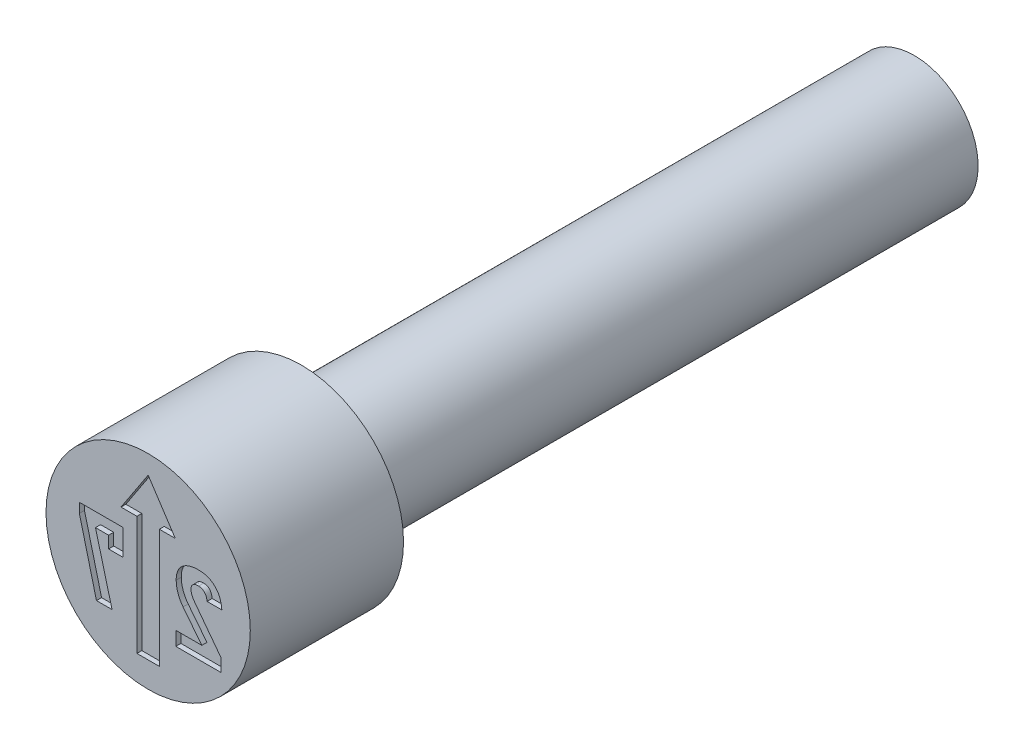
ISO-10303-21;
HEADER;
FILE_DESCRIPTION(('STEP AP214'),'2;1');
FILE_NAME('part.step','',(''),(''),'','','');
FILE_SCHEMA(('AUTOMOTIVE_DESIGN { 1 0 10303 214 1 1 1 1 }'));
ENDSEC;
DATA;
#1=APPLICATION_CONTEXT('core data for automotive mechanical design processes');
#2=APPLICATION_PROTOCOL_DEFINITION('international standard','automotive_design',2000,#1);
#3=PRODUCT_CONTEXT('',#1,'mechanical');
#4=PRODUCT('Part','Part','',(#3));
#5=PRODUCT_RELATED_PRODUCT_CATEGORY('part','',(#4));
#6=PRODUCT_DEFINITION_FORMATION('','',#4);
#7=PRODUCT_DEFINITION_CONTEXT('part definition',#1,'design');
#8=PRODUCT_DEFINITION('design','',#6,#7);
#9=PRODUCT_DEFINITION_SHAPE('','',#8);
#10=(LENGTH_UNIT() NAMED_UNIT(*) SI_UNIT(.MILLI.,.METRE.));
#11=(NAMED_UNIT(*) PLANE_ANGLE_UNIT() SI_UNIT($,.RADIAN.));
#12=(NAMED_UNIT(*) SI_UNIT($,.STERADIAN.) SOLID_ANGLE_UNIT());
#13=UNCERTAINTY_MEASURE_WITH_UNIT(LENGTH_MEASURE(1.E-05),#10,'distance_accuracy_value','');
#14=(GEOMETRIC_REPRESENTATION_CONTEXT(3) GLOBAL_UNCERTAINTY_ASSIGNED_CONTEXT((#13)) GLOBAL_UNIT_ASSIGNED_CONTEXT((#10,
#11,#12)) REPRESENTATION_CONTEXT('',''));
#15=CARTESIAN_POINT('',(0.,0.,0.));
#16=DIRECTION('',(0.,0.,1.));
#17=DIRECTION('',(1.,0.,0.));
#18=AXIS2_PLACEMENT_3D('',#15,#16,#17);
#19=CARTESIAN_POINT('',(-0.22,-1.5,-2.72238250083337));
#20=DIRECTION('',(-1.,0.,0.));
#21=DIRECTION('',(0.,0.,1.));
#22=AXIS2_PLACEMENT_3D('',#19,#20,#21);
#23=PLANE('',#22);
#24=DIRECTION('',(0.,-1.,0.));
#25=VECTOR('',#24,1.);
#26=CARTESIAN_POINT('',(-0.22,0.825524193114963,-0.0955992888));
#27=LINE('',#26,#25);
#28=CARTESIAN_POINT('',(-0.22,0.825524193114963,-0.0955992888));
#29=VERTEX_POINT('',#28);
#30=CARTESIAN_POINT('',(-0.22,-1.5,-0.0955992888));
#31=VERTEX_POINT('',#30);
#32=EDGE_CURVE('E439',#29,#31,#27,.T.);
#33=ORIENTED_EDGE('',*,*,#32,.F.);
#34=DIRECTION('',(0.,0.,1.));
#35=VECTOR('',#34,1.);
#36=CARTESIAN_POINT('',(-0.22,0.825524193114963,-0.1777996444));
#37=LINE('',#36,#35);
#38=CARTESIAN_POINT('',(-0.22,0.825524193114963,0.));
#39=VERTEX_POINT('',#38);
#40=EDGE_CURVE('E425',#39,#29,#37,.F.);
#41=ORIENTED_EDGE('',*,*,#40,.F.);
#42=DIRECTION('',(0.,1.,0.));
#43=VECTOR('',#42,1.);
#44=CARTESIAN_POINT('',(-0.22,0.,0.));
#45=LINE('',#44,#43);
#46=CARTESIAN_POINT('',(-0.22,-1.5,0.));
#47=VERTEX_POINT('',#46);
#48=EDGE_CURVE('E468',#47,#39,#45,.T.);
#49=ORIENTED_EDGE('',*,*,#48,.F.);
#50=DIRECTION('',(0.,0.,-1.));
#51=VECTOR('',#50,1.);
#52=CARTESIAN_POINT('',(-0.22,-1.5,-2.72238250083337));
#53=LINE('',#52,#51);
#54=EDGE_CURVE('E470',#47,#31,#53,.T.);
#55=ORIENTED_EDGE('',*,*,#54,.T.);
#56=EDGE_LOOP('',(#33,#41,#49,#55));
#57=FACE_BOUND('',#56,.T.);
#58=ADVANCED_FACE('F37',(#57),#23,.F.);
#59=CARTESIAN_POINT('',(3.41059817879E-13,0.825524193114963,-0.1777996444));
#60=DIRECTION('',(0.,1.,0.));
#61=DIRECTION('',(0.,0.,1.));
#62=AXIS2_PLACEMENT_3D('',#59,#60,#61);
#63=PLANE('',#62);
#64=ORIENTED_EDGE('',*,*,#40,.T.);
#65=DIRECTION('',(1.,0.,0.));
#66=VECTOR('',#65,1.);
#67=CARTESIAN_POINT('',(-0.532051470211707,0.825524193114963,-0.0955992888));
#68=LINE('',#67,#66);
#69=CARTESIAN_POINT('',(-0.532051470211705,0.825524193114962,-0.0955992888));
#70=VERTEX_POINT('',#69);
#71=EDGE_CURVE('E427',#70,#29,#68,.T.);
#72=ORIENTED_EDGE('',*,*,#71,.F.);
#73=DIRECTION('',(0.,0.,1.));
#74=VECTOR('',#73,1.);
#75=CARTESIAN_POINT('',(-0.532051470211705,0.825524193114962,-0.8127983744));
#76=LINE('',#75,#74);
#77=CARTESIAN_POINT('',(-0.532051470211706,0.825524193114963,0.));
#78=VERTEX_POINT('',#77);
#79=EDGE_CURVE('E432',#70,#78,#76,.T.);
#80=ORIENTED_EDGE('',*,*,#79,.T.);
#81=DIRECTION('',(1.,0.,0.));
#82=VECTOR('',#81,1.);
#83=CARTESIAN_POINT('',(0.999998,0.825524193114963,0.));
#84=LINE('',#83,#82);
#85=EDGE_CURVE('E430',#39,#78,#84,.F.);
#86=ORIENTED_EDGE('',*,*,#85,.F.);
#87=EDGE_LOOP('',(#64,#72,#80,#86));
#88=FACE_BOUND('',#87,.T.);
#89=ADVANCED_FACE('F415',(#88),#63,.T.);
#90=CARTESIAN_POINT('',(-0.902397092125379,0.263394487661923,-0.8127983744));
#91=DIRECTION('',(-0.835059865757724,0.550159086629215,0.));
#92=DIRECTION('',(-0.550159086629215,-0.835059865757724,0.));
#93=AXIS2_PLACEMENT_3D('',#90,#91,#92);
#94=PLANE('',#93);
#95=DIRECTION('',(-0.550159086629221,-0.83505986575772,0.));
#96=VECTOR('',#95,1.);
#97=CARTESIAN_POINT('',(0.,1.63309938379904,-0.0955992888));
#98=LINE('',#97,#96);
#99=CARTESIAN_POINT('',(0.,1.63309938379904,-0.0955992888));
#100=VERTEX_POINT('',#99);
#101=EDGE_CURVE('E441',#100,#70,#98,.T.);
#102=ORIENTED_EDGE('',*,*,#101,.F.);
#103=DIRECTION('',(0.,0.,1.));
#104=VECTOR('',#103,1.);
#105=CARTESIAN_POINT('',(0.,1.63309938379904,-0.8127983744));
#106=LINE('',#105,#104);
#107=CARTESIAN_POINT('',(0.,1.63309938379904,0.));
#108=VERTEX_POINT('',#107);
#109=EDGE_CURVE('E480',#100,#108,#106,.T.);
#110=ORIENTED_EDGE('',*,*,#109,.T.);
#111=DIRECTION('',(0.550159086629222,0.835059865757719,0.));
#112=VECTOR('',#111,1.);
#113=CARTESIAN_POINT('',(-0.532051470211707,0.825524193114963,0.));
#114=LINE('',#113,#112);
#115=EDGE_CURVE('E464',#78,#108,#114,.T.);
#116=ORIENTED_EDGE('',*,*,#115,.F.);
#117=ORIENTED_EDGE('',*,*,#79,.F.);
#118=EDGE_LOOP('',(#102,#110,#116,#117));
#119=FACE_BOUND('',#118,.T.);
#120=ADVANCED_FACE('F412',(#119),#94,.F.);
#121=CARTESIAN_POINT('',(0.,1.63309938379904,-0.8127983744));
#122=DIRECTION('',(0.835059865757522,0.550159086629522,0.));
#123=DIRECTION('',(-0.550159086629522,0.835059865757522,0.));
#124=AXIS2_PLACEMENT_3D('',#121,#122,#123);
#125=PLANE('',#124);
#126=DIRECTION('',(-0.550159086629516,0.835059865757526,0.));
#127=VECTOR('',#126,1.);
#128=CARTESIAN_POINT('',(0.532051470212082,0.825524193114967,-0.0955992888));
#129=LINE('',#128,#127);
#130=CARTESIAN_POINT('',(0.532051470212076,0.825524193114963,-0.0955992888));
#131=VERTEX_POINT('',#130);
#132=EDGE_CURVE('E445',#131,#100,#129,.T.);
#133=ORIENTED_EDGE('',*,*,#132,.F.);
#134=DIRECTION('',(0.,0.,1.));
#135=VECTOR('',#134,1.);
#136=CARTESIAN_POINT('',(0.532051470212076,0.825524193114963,-0.1777996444));
#137=LINE('',#136,#135);
#138=CARTESIAN_POINT('',(0.532051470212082,0.825524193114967,0.));
#139=VERTEX_POINT('',#138);
#140=EDGE_CURVE('E477',#139,#131,#137,.F.);
#141=ORIENTED_EDGE('',*,*,#140,.F.);
#142=DIRECTION('',(0.550159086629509,-0.83505986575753,0.));
#143=VECTOR('',#142,1.);
#144=CARTESIAN_POINT('',(0.,1.63309938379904,0.));
#145=LINE('',#144,#143);
#146=EDGE_CURVE('E461',#108,#139,#145,.T.);
#147=ORIENTED_EDGE('',*,*,#146,.F.);
#148=ORIENTED_EDGE('',*,*,#109,.F.);
#149=EDGE_LOOP('',(#133,#141,#147,#148));
#150=FACE_BOUND('',#149,.T.);
#151=ADVANCED_FACE('F408',(#150),#125,.F.);
#152=CARTESIAN_POINT('',(3.41059817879E-13,0.825524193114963,-0.1777996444));
#153=DIRECTION('',(0.,1.,0.));
#154=DIRECTION('',(0.,0.,1.));
#155=AXIS2_PLACEMENT_3D('',#152,#153,#154);
#156=PLANE('',#155);
#157=ORIENTED_EDGE('',*,*,#140,.T.);
#158=DIRECTION('',(1.,0.,0.));
#159=VECTOR('',#158,1.);
#160=CARTESIAN_POINT('',(0.22,0.825524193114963,-0.0955992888));
#161=LINE('',#160,#159);
#162=CARTESIAN_POINT('',(0.22,0.825524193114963,-0.0955992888));
#163=VERTEX_POINT('',#162);
#164=EDGE_CURVE('E502',#163,#131,#161,.T.);
#165=ORIENTED_EDGE('',*,*,#164,.F.);
#166=DIRECTION('',(0.,0.,1.));
#167=VECTOR('',#166,1.);
#168=CARTESIAN_POINT('',(0.22,0.825524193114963,-2.72238250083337));
#169=LINE('',#168,#167);
#170=CARTESIAN_POINT('',(0.22,0.825524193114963,0.));
#171=VERTEX_POINT('',#170);
#172=EDGE_CURVE('E475',#163,#171,#169,.T.);
#173=ORIENTED_EDGE('',*,*,#172,.T.);
#174=DIRECTION('',(1.,0.,0.));
#175=VECTOR('',#174,1.);
#176=CARTESIAN_POINT('',(0.999998,0.825524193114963,0.));
#177=LINE('',#176,#175);
#178=EDGE_CURVE('E458',#139,#171,#177,.F.);
#179=ORIENTED_EDGE('',*,*,#178,.F.);
#180=EDGE_LOOP('',(#157,#165,#173,#179));
#181=FACE_BOUND('',#180,.T.);
#182=ADVANCED_FACE('F404',(#181),#156,.T.);
#183=CARTESIAN_POINT('',(0.22,-1.5,-2.72238250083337));
#184=DIRECTION('',(1.,0.,0.));
#185=DIRECTION('',(0.,1.,0.));
#186=AXIS2_PLACEMENT_3D('',#183,#184,#185);
#187=PLANE('',#186);
#188=DIRECTION('',(0.,1.,0.));
#189=VECTOR('',#188,1.);
#190=CARTESIAN_POINT('',(0.22,-1.5,-0.0955992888));
#191=LINE('',#190,#189);
#192=CARTESIAN_POINT('',(0.22,-1.5,-0.0955992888));
#193=VERTEX_POINT('',#192);
#194=EDGE_CURVE('E433',#193,#163,#191,.T.);
#195=ORIENTED_EDGE('',*,*,#194,.F.);
#196=DIRECTION('',(0.,0.,-1.));
#197=VECTOR('',#196,1.);
#198=CARTESIAN_POINT('',(0.22,-1.5,-2.72238250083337));
#199=LINE('',#198,#197);
#200=CARTESIAN_POINT('',(0.22,-1.5,0.));
#201=VERTEX_POINT('',#200);
#202=EDGE_CURVE('E473',#193,#201,#199,.F.);
#203=ORIENTED_EDGE('',*,*,#202,.T.);
#204=DIRECTION('',(0.,1.,0.));
#205=VECTOR('',#204,1.);
#206=CARTESIAN_POINT('',(0.22,0.,0.));
#207=LINE('',#206,#205);
#208=EDGE_CURVE('E455',#171,#201,#207,.F.);
#209=ORIENTED_EDGE('',*,*,#208,.F.);
#210=ORIENTED_EDGE('',*,*,#172,.F.);
#211=EDGE_LOOP('',(#195,#203,#209,#210));
#212=FACE_BOUND('',#211,.T.);
#213=ADVANCED_FACE('F400',(#212),#187,.F.);
#214=CARTESIAN_POINT('',(-0.22,-1.5,-2.72238250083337));
#215=DIRECTION('',(0.,-1.,0.));
#216=DIRECTION('',(0.,0.,-1.));
#217=AXIS2_PLACEMENT_3D('',#214,#215,#216);
#218=PLANE('',#217);
#219=DIRECTION('',(1.,0.,0.));
#220=VECTOR('',#219,1.);
#221=CARTESIAN_POINT('',(-0.22,-1.5,-0.0955992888));
#222=LINE('',#221,#220);
#223=EDGE_CURVE('E443',#31,#193,#222,.T.);
#224=ORIENTED_EDGE('',*,*,#223,.F.);
#225=ORIENTED_EDGE('',*,*,#54,.F.);
#226=DIRECTION('',(1.,0.,0.));
#227=VECTOR('',#226,1.);
#228=CARTESIAN_POINT('',(0.999998,-1.5,0.));
#229=LINE('',#228,#227);
#230=EDGE_CURVE('E452',#201,#47,#229,.F.);
#231=ORIENTED_EDGE('',*,*,#230,.F.);
#232=ORIENTED_EDGE('',*,*,#202,.F.);
#233=EDGE_LOOP('',(#224,#225,#231,#232));
#234=FACE_BOUND('',#233,.T.);
#235=ADVANCED_FACE('F383',(#234),#218,.F.);
#236=CARTESIAN_POINT('',(0.999998,0.,0.));
#237=DIRECTION('',(0.,0.,1.));
#238=DIRECTION('',(1.,0.,0.));
#239=AXIS2_PLACEMENT_3D('',#236,#237,#238);
#240=PLANE('',#239);
#241=DIRECTION('',(-1.,0.,0.));
#242=VECTOR('',#241,1.);
#243=CARTESIAN_POINT('',(-0.493165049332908,0.5,0.));
#244=LINE('',#243,#242);
#245=CARTESIAN_POINT('',(-0.493165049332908,0.5,0.));
#246=VERTEX_POINT('',#245);
#247=CARTESIAN_POINT('',(-1.34665530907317,0.5,0.));
#248=VERTEX_POINT('',#247);
#249=EDGE_CURVE('E53',#246,#248,#244,.T.);
#250=ORIENTED_EDGE('',*,*,#249,.F.);
#251=DIRECTION('',(0.,1.,0.));
#252=VECTOR('',#251,1.);
#253=CARTESIAN_POINT('',(-0.493165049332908,-0.00649350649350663,0.));
#254=LINE('',#253,#252);
#255=CARTESIAN_POINT('',(-0.493165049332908,-0.00649350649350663,0.));
#256=VERTEX_POINT('',#255);
#257=EDGE_CURVE('E274',#256,#246,#254,.T.);
#258=ORIENTED_EDGE('',*,*,#257,.F.);
#259=DIRECTION('',(1.,0.,0.));
#260=VECTOR('',#259,1.);
#261=CARTESIAN_POINT('',(-0.774719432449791,-0.00649350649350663,0.));
#262=LINE('',#261,#260);
#263=CARTESIAN_POINT('',(-0.774719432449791,-0.00649350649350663,0.));
#264=VERTEX_POINT('',#263);
#265=EDGE_CURVE('E277',#264,#256,#262,.T.);
#266=ORIENTED_EDGE('',*,*,#265,.F.);
#267=DIRECTION('',(0.,-1.,0.));
#268=VECTOR('',#267,1.);
#269=CARTESIAN_POINT('',(-0.774719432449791,0.227272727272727,0.));
#270=LINE('',#269,#268);
#271=CARTESIAN_POINT('',(-0.774719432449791,0.227272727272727,0.));
#272=VERTEX_POINT('',#271);
#273=EDGE_CURVE('E311',#272,#264,#270,.T.);
#274=ORIENTED_EDGE('',*,*,#273,.F.);
#275=DIRECTION('',(1.,0.,0.));
#276=VECTOR('',#275,1.);
#277=CARTESIAN_POINT('',(-1.03131439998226,0.227272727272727,0.));
#278=LINE('',#277,#276);
#279=CARTESIAN_POINT('',(-1.03131439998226,0.227272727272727,0.));
#280=VERTEX_POINT('',#279);
#281=EDGE_CURVE('E308',#280,#272,#278,.T.);
#282=ORIENTED_EDGE('',*,*,#281,.F.);
#283=DIRECTION('',(-0.255602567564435,0.966781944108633,0.));
#284=VECTOR('',#283,1.);
#285=CARTESIAN_POINT('',(-0.706841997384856,-1.,0.));
#286=LINE('',#285,#284);
#287=CARTESIAN_POINT('',(-0.706841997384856,-1.,0.));
#288=VERTEX_POINT('',#287);
#289=EDGE_CURVE('E305',#288,#280,#286,.T.);
#290=ORIENTED_EDGE('',*,*,#289,.F.);
#291=DIRECTION('',(1.,0.,0.));
#292=VECTOR('',#291,1.);
#293=CARTESIAN_POINT('',(-1.01183388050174,-1.,0.));
#294=LINE('',#293,#292);
#295=CARTESIAN_POINT('',(-1.01183388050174,-1.,0.));
#296=VERTEX_POINT('',#295);
#297=EDGE_CURVE('E302',#296,#288,#294,.T.);
#298=ORIENTED_EDGE('',*,*,#297,.F.);
#299=DIRECTION('',(0.247293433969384,-0.968940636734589,0.));
#300=VECTOR('',#299,1.);
#301=CARTESIAN_POINT('',(-1.34665530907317,0.311891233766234,0.));
#302=LINE('',#301,#300);
#303=CARTESIAN_POINT('',(-1.34665530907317,0.311891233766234,0.));
#304=VERTEX_POINT('',#303);
#305=EDGE_CURVE('E299',#304,#296,#302,.T.);
#306=ORIENTED_EDGE('',*,*,#305,.F.);
#307=DIRECTION('',(0.,-1.,0.));
#308=VECTOR('',#307,1.);
#309=CARTESIAN_POINT('',(-1.34665530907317,0.5,0.));
#310=LINE('',#309,#308);
#311=EDGE_CURVE('E297',#248,#304,#310,.T.);
#312=ORIENTED_EDGE('',*,*,#311,.F.);
#313=EDGE_LOOP('',(#250,#258,#266,#274,#282,#290,#298,#306,#312));
#314=FACE_BOUND('',#313,.T.);
#315=DIRECTION('',(1.,0.,0.));
#316=VECTOR('',#315,1.);
#317=CARTESIAN_POINT('',(0.540532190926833,-1.,0.));
#318=LINE('',#317,#316);
#319=CARTESIAN_POINT('',(0.540532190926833,-1.,0.));
#320=VERTEX_POINT('',#319);
#321=CARTESIAN_POINT('',(1.42385199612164,-1.,0.));
#322=VERTEX_POINT('',#321);
#323=EDGE_CURVE('E61',#320,#322,#318,.T.);
#324=ORIENTED_EDGE('',*,*,#323,.F.);
#325=DIRECTION('',(0.,-1.,0.));
#326=VECTOR('',#325,1.);
#327=CARTESIAN_POINT('',(0.540532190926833,-0.727272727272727,0.));
#328=LINE('',#327,#326);
#329=CARTESIAN_POINT('',(0.540532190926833,-0.727272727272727,0.));
#330=VERTEX_POINT('',#329);
#331=EDGE_CURVE('E335',#330,#320,#328,.T.);
#332=ORIENTED_EDGE('',*,*,#331,.F.);
#333=DIRECTION('',(-1.,0.,0.));
#334=VECTOR('',#333,1.);
#335=CARTESIAN_POINT('',(1.05098267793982,-0.727272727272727,0.));
#336=LINE('',#335,#334);
#337=CARTESIAN_POINT('',(1.05098267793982,-0.727272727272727,0.));
#338=VERTEX_POINT('',#337);
#339=EDGE_CURVE('E542',#338,#330,#336,.T.);
#340=ORIENTED_EDGE('',*,*,#339,.F.);
#341=DIRECTION('',(0.618183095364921,-0.786034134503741,0.));
#342=VECTOR('',#341,1.);
#343=CARTESIAN_POINT('',(0.683287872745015,-0.25974025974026,0.));
#344=LINE('',#343,#342);
#345=CARTESIAN_POINT('',(0.683287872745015,-0.25974025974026,0.));
#346=VERTEX_POINT('',#345);
#347=EDGE_CURVE('E545',#346,#338,#344,.T.);
#348=ORIENTED_EDGE('',*,*,#347,.F.);
#349=CARTESIAN_POINT('',(0.548750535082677,0.126217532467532,0.));
#350=CARTESIAN_POINT('',(0.549138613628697,0.10915031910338,0.));
#351=CARTESIAN_POINT('',(0.549915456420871,0.0749857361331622,0.));
#352=CARTESIAN_POINT('',(0.5569277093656,0.0238536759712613,0.));
#353=CARTESIAN_POINT('',(0.5682278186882,-0.0270173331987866,0.));
#354=CARTESIAN_POINT('',(0.583746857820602,-0.077381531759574,0.));
#355=CARTESIAN_POINT('',(0.603025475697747,-0.126366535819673,0.));
#356=CARTESIAN_POINT('',(0.626163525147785,-0.173301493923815,0.));
#357=CARTESIAN_POINT('',(0.652277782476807,-0.218207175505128,0.));
#358=CARTESIAN_POINT('',(0.672970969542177,-0.245922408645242,0.));
#359=CARTESIAN_POINT('',(0.683287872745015,-0.25974025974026,0.));
#360=B_SPLINE_CURVE_WITH_KNOTS('',3,(#349,#350,#351,#352,#353,#354,#355,#356,#357,#358,#359),
.UNSPECIFIED.,.F.,.F.,(4,1,1,1,1,1,1,1,4),(0.,0.123046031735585,0.246309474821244,
0.371480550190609,0.498560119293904,0.626024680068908,0.750715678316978,0.875715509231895,1.),.UNSPECIFIED.);
#361=CARTESIAN_POINT('',(0.548750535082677,0.126217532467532,0.));
#362=VERTEX_POINT('',#361);
#363=EDGE_CURVE('E548',#362,#346,#360,.T.);
#364=ORIENTED_EDGE('',*,*,#363,.F.);
#365=DIRECTION('',(0.,-1.,0.));
#366=VECTOR('',#365,1.);
#367=CARTESIAN_POINT('',(0.548750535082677,0.127435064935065,0.));
#368=LINE('',#367,#366);
#369=CARTESIAN_POINT('',(0.548750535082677,0.127435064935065,0.));
#370=VERTEX_POINT('',#369);
#371=EDGE_CURVE('E553',#370,#362,#368,.T.);
#372=ORIENTED_EDGE('',*,*,#371,.F.);
#373=CARTESIAN_POINT('',(0.990410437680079,0.519480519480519,0.));
#374=CARTESIAN_POINT('',(0.973351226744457,0.519238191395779,0.));
#375=CARTESIAN_POINT('',(0.940173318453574,0.518766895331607,0.));
#376=CARTESIAN_POINT('',(0.89187202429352,0.513679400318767,0.));
#377=CARTESIAN_POINT('',(0.84642562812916,0.506000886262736,0.));
#378=CARTESIAN_POINT('',(0.803907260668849,0.494767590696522,0.));
#379=CARTESIAN_POINT('',(0.764487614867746,0.480114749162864,0.));
#380=CARTESIAN_POINT('',(0.728048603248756,0.462447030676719,0.));
#381=CARTESIAN_POINT('',(0.694514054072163,0.441613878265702,0.));
#382=CARTESIAN_POINT('',(0.664140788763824,0.417570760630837,0.));
#383=CARTESIAN_POINT('',(0.636812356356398,0.390754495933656,0.));
#384=CARTESIAN_POINT('',(0.613289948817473,0.360892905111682,0.));
#385=CARTESIAN_POINT('',(0.592927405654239,0.328589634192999,0.));
#386=CARTESIAN_POINT('',(0.577010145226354,0.293218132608,0.));
#387=CARTESIAN_POINT('',(0.563905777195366,0.255610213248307,0.));
#388=CARTESIAN_POINT('',(0.555420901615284,0.215091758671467,0.));
#389=CARTESIAN_POINT('',(0.549703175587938,0.172139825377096,0.));
#390=CARTESIAN_POINT('',(0.549073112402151,0.142572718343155,0.));
#391=CARTESIAN_POINT('',(0.548750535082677,0.127435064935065,0.));
#392=B_SPLINE_CURVE_WITH_KNOTS('',3,(#373,#374,#375,#376,#377,#378,#379,#380,#381,#382,#383,
#384,#385,#386,#387,#388,#389,#390,#391),.UNSPECIFIED.,.F.,.F.,(4,1,1,1,1,1,1,1,1,1,1,1,1,1,1,1,
4),(0.,0.0762312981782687,0.148259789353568,0.216860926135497,0.28210063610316,
0.344528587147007,0.404571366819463,0.462840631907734,0.520642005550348,0.577409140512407,
0.633580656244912,0.690215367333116,0.747647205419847,0.806597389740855,0.867894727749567,
0.932365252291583,1.),.UNSPECIFIED.);
#393=CARTESIAN_POINT('',(0.990410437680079,0.519480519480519,0.));
#394=VERTEX_POINT('',#393);
#395=EDGE_CURVE('E559',#394,#370,#392,.T.);
#396=ORIENTED_EDGE('',*,*,#395,.F.);
#397=CARTESIAN_POINT('',(1.44241936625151,0.0692978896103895,0.));
#398=CARTESIAN_POINT('',(1.44099552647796,0.0866849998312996,0.));
#399=CARTESIAN_POINT('',(1.4382162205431,0.120624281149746,0.));
#400=CARTESIAN_POINT('',(1.42910444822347,0.169719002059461,0.));
#401=CARTESIAN_POINT('',(1.41732784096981,0.215962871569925,0.));
#402=CARTESIAN_POINT('',(1.40234640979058,0.259346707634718,0.));
#403=CARTESIAN_POINT('',(1.38309521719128,0.29936817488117,0.));
#404=CARTESIAN_POINT('',(1.36146591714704,0.3368639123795,0.));
#405=CARTESIAN_POINT('',(1.33545128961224,0.370674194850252,0.));
#406=CARTESIAN_POINT('',(1.30697463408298,0.401930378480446,0.));
#407=CARTESIAN_POINT('',(1.27525673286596,0.429460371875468,0.));
#408=CARTESIAN_POINT('',(1.24143673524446,0.453745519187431,0.));
#409=CARTESIAN_POINT('',(1.20500322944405,0.473954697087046,0.));
#410=CARTESIAN_POINT('',(1.16651010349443,0.490719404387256,0.));
#411=CARTESIAN_POINT('',(1.12553057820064,0.503443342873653,0.));
#412=CARTESIAN_POINT('',(1.08259994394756,0.51297454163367,0.));
#413=CARTESIAN_POINT('',(1.03722543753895,0.518471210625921,0.));
#414=CARTESIAN_POINT('',(1.00625306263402,0.519138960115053,0.));
#415=CARTESIAN_POINT('',(0.990410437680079,0.519480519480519,0.));
#416=B_SPLINE_CURVE_WITH_KNOTS('',3,(#397,#398,#399,#400,#401,#402,#403,#404,#405,#406,#407,
#408,#409,#410,#411,#412,#413,#414,#415),.UNSPECIFIED.,.F.,.F.,(4,1,1,1,1,1,1,1,1,1,1,1,1,1,1,1,
4),(0.,0.0733268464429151,0.14313249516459,0.209679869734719,0.273918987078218,0.33576228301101,
0.396210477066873,0.45560885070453,0.514796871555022,0.573764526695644,0.631900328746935,
0.689592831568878,0.748648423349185,0.808163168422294,0.86976604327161,0.933384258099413,1.),.UNSPECIFIED.);
#417=CARTESIAN_POINT('',(1.44241936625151,0.0692978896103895,0.));
#418=VERTEX_POINT('',#417);
#419=EDGE_CURVE('E564',#418,#394,#416,.T.);
#420=ORIENTED_EDGE('',*,*,#419,.F.);
#421=DIRECTION('',(0.,1.,0.));
#422=VECTOR('',#421,1.);
#423=CARTESIAN_POINT('',(1.44241936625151,0.0683847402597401,0.));
#424=LINE('',#423,#422);
#425=CARTESIAN_POINT('',(1.44241936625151,0.0683847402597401,0.));
#426=VERTEX_POINT('',#425);
#427=EDGE_CURVE('E572',#426,#418,#424,.T.);
#428=ORIENTED_EDGE('',*,*,#427,.F.);
#429=DIRECTION('',(1.,0.,0.));
#430=VECTOR('',#429,1.);
#431=CARTESIAN_POINT('',(1.15386417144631,0.0683847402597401,0.));
#432=LINE('',#431,#430);
#433=CARTESIAN_POINT('',(1.15386417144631,0.0683847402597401,0.));
#434=VERTEX_POINT('',#433);
#435=EDGE_CURVE('E578',#434,#426,#432,.T.);
#436=ORIENTED_EDGE('',*,*,#435,.F.);
#437=DIRECTION('',(0.,-1.,0.));
#438=VECTOR('',#437,1.);
#439=CARTESIAN_POINT('',(1.15386417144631,0.0692978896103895,0.));
#440=LINE('',#439,#438);
#441=CARTESIAN_POINT('',(1.15386417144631,0.0692978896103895,0.));
#442=VERTEX_POINT('',#441);
#443=EDGE_CURVE('E581',#442,#434,#440,.T.);
#444=ORIENTED_EDGE('',*,*,#443,.F.);
#445=CARTESIAN_POINT('',(0.988279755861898,0.246753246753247,0.));
#446=CARTESIAN_POINT('',(0.999306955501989,0.246322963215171,0.));
#447=CARTESIAN_POINT('',(1.02073318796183,0.245486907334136,0.));
#448=CARTESIAN_POINT('',(1.05106567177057,0.236221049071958,0.));
#449=CARTESIAN_POINT('',(1.07839819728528,0.221686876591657,0.));
#450=CARTESIAN_POINT('',(1.10196100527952,0.200948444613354,0.));
#451=CARTESIAN_POINT('',(1.12147279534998,0.174910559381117,0.));
#452=CARTESIAN_POINT('',(1.13730850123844,0.14424880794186,0.));
#453=CARTESIAN_POINT('',(1.14806399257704,0.108409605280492,0.));
#454=CARTESIAN_POINT('',(1.15186856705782,0.0827546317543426,0.));
#455=CARTESIAN_POINT('',(1.15386417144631,0.0692978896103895,0.));
#456=B_SPLINE_CURVE_WITH_KNOTS('',3,(#445,#446,#447,#448,#449,#450,#451,#452,#453,#454,#455),
.UNSPECIFIED.,.F.,.F.,(4,1,1,1,1,1,1,1,4),(0.,0.122603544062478,0.238222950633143,
0.350089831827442,0.46555970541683,0.58502806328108,0.711014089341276,0.848418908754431,1.),.UNSPECIFIED.);
#457=CARTESIAN_POINT('',(0.988279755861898,0.246753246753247,0.));
#458=VERTEX_POINT('',#457);
#459=EDGE_CURVE('E584',#458,#442,#456,.T.);
#460=ORIENTED_EDGE('',*,*,#459,.F.);
#461=CARTESIAN_POINT('',(0.838523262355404,0.119521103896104,0.));
#462=CARTESIAN_POINT('',(0.838939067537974,0.129111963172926,0.));
#463=CARTESIAN_POINT('',(0.839735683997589,0.14748652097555,0.));
#464=CARTESIAN_POINT('',(0.847241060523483,0.173376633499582,0.));
#465=CARTESIAN_POINT('',(0.859541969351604,0.195922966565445,0.));
#466=CARTESIAN_POINT('',(0.877159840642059,0.214546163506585,0.));
#467=CARTESIAN_POINT('',(0.899092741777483,0.229275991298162,0.));
#468=CARTESIAN_POINT('',(0.925336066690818,0.239656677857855,0.));
#469=CARTESIAN_POINT('',(0.955546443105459,0.245609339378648,0.));
#470=CARTESIAN_POINT('',(0.976989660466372,0.246358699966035,0.));
#471=CARTESIAN_POINT('',(0.988279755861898,0.246753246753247,0.));
#472=B_SPLINE_CURVE_WITH_KNOTS('',3,(#461,#462,#463,#464,#465,#466,#467,#468,#469,#470,#471),
.UNSPECIFIED.,.F.,.F.,(4,1,1,1,1,1,1,1,4),(0.,0.128749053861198,0.246662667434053,
0.359069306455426,0.47107757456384,0.588039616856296,0.711712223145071,0.848213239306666,1.),.UNSPECIFIED.);
#473=CARTESIAN_POINT('',(0.838523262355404,0.119521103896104,0.));
#474=VERTEX_POINT('',#473);
#475=EDGE_CURVE('E589',#474,#458,#472,.T.);
#476=ORIENTED_EDGE('',*,*,#475,.F.);
#477=DIRECTION('',(0.,1.,0.));
#478=VECTOR('',#477,1.);
#479=CARTESIAN_POINT('',(0.838523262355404,0.117390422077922,0.));
#480=LINE('',#479,#478);
#481=CARTESIAN_POINT('',(0.838523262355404,0.117390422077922,0.));
#482=VERTEX_POINT('',#481);
#483=EDGE_CURVE('E597',#482,#474,#480,.T.);
#484=ORIENTED_EDGE('',*,*,#483,.F.);
#485=CARTESIAN_POINT('',(0.911270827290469,-0.0658482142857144,0.));
#486=CARTESIAN_POINT('',(0.900534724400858,-0.0507204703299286,0.));
#487=CARTESIAN_POINT('',(0.879615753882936,-0.0212445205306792,0.));
#488=CARTESIAN_POINT('',(0.860682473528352,0.0192347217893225,0.));
#489=CARTESIAN_POINT('',(0.848887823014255,0.0509709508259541,0.));
#490=CARTESIAN_POINT('',(0.843266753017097,0.0739859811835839,0.));
#491=CARTESIAN_POINT('',(0.839256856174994,0.0959444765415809,0.));
#492=CARTESIAN_POINT('',(0.838763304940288,0.110372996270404,0.));
#493=CARTESIAN_POINT('',(0.838523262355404,0.117390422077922,0.));
#494=B_SPLINE_CURVE_WITH_KNOTS('',3,(#485,#486,#487,#488,#489,#490,#491,#492,#493),
.UNSPECIFIED.,.F.,.F.,(4,1,1,1,1,1,4),(0.,0.27737542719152,0.540457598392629,0.666416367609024,
0.784009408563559,0.894951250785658,1.),.UNSPECIFIED.);
#495=CARTESIAN_POINT('',(0.911270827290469,-0.0658482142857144,0.));
#496=VERTEX_POINT('',#495);
#497=EDGE_CURVE('E603',#496,#482,#494,.T.);
#498=ORIENTED_EDGE('',*,*,#497,.F.);
#499=DIRECTION('',(-0.602458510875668,0.798150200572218,0.));
#500=VECTOR('',#499,1.);
#501=CARTESIAN_POINT('',(1.42385199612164,-0.744926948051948,0.));
#502=LINE('',#501,#500);
#503=CARTESIAN_POINT('',(1.42385199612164,-0.744926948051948,0.));
#504=VERTEX_POINT('',#503);
#505=EDGE_CURVE('E608',#504,#496,#502,.T.);
#506=ORIENTED_EDGE('',*,*,#505,.F.);
#507=DIRECTION('',(0.,1.,0.));
#508=VECTOR('',#507,1.);
#509=CARTESIAN_POINT('',(1.42385199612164,-1.,0.));
#510=LINE('',#509,#508);
#511=EDGE_CURVE('E614',#322,#504,#510,.T.);
#512=ORIENTED_EDGE('',*,*,#511,.F.);
#513=EDGE_LOOP('',(#324,#332,#340,#348,#364,#372,#396,#420,#428,#436,#444,#460,#476,#484,#498,
#506,#512));
#514=FACE_BOUND('',#513,.T.);
#515=CARTESIAN_POINT('',(0.,0.,0.));
#516=DIRECTION('',(0.,0.,-1.));
#517=DIRECTION('',(-1.,0.,0.));
#518=AXIS2_PLACEMENT_3D('',#515,#516,#517);
#519=CIRCLE('',#518,1.999996);
#520=CARTESIAN_POINT('',(-1.999996,0.,0.));
#521=VERTEX_POINT('',#520);
#522=EDGE_CURVE('E40',#521,#521,#519,.T.);
#523=ORIENTED_EDGE('',*,*,#522,.F.);
#524=EDGE_LOOP('',(#523));
#525=FACE_BOUND('',#524,.T.);
#526=ORIENTED_EDGE('',*,*,#208,.T.);
#527=ORIENTED_EDGE('',*,*,#230,.T.);
#528=ORIENTED_EDGE('',*,*,#48,.T.);
#529=ORIENTED_EDGE('',*,*,#85,.T.);
#530=ORIENTED_EDGE('',*,*,#115,.T.);
#531=ORIENTED_EDGE('',*,*,#146,.T.);
#532=ORIENTED_EDGE('',*,*,#178,.T.);
#533=EDGE_LOOP('',(#526,#527,#528,#529,#530,#531,#532));
#534=FACE_BOUND('',#533,.T.);
#535=ADVANCED_FACE('F378',(#314,#514,#525,#534),#240,.T.);
#536=CARTESIAN_POINT('',(0.,0.,-1.499997));
#537=DIRECTION('',(0.,0.,-1.));
#538=DIRECTION('',(-1.,0.,0.));
#539=AXIS2_PLACEMENT_3D('',#536,#537,#538);
#540=CYLINDRICAL_SURFACE('',#539,1.999996);
#541=ORIENTED_EDGE('',*,*,#522,.T.);
#542=EDGE_LOOP('',(#541));
#543=FACE_BOUND('',#542,.T.);
#544=CARTESIAN_POINT('',(0.,0.,-2.999994));
#545=DIRECTION('',(0.,0.,-1.));
#546=DIRECTION('',(-1.,0.,0.));
#547=AXIS2_PLACEMENT_3D('',#544,#545,#546);
#548=CIRCLE('',#547,1.999996);
#549=CARTESIAN_POINT('',(-1.999996,0.,-2.999994));
#550=VERTEX_POINT('',#549);
#551=EDGE_CURVE('E484',#550,#550,#548,.T.);
#552=ORIENTED_EDGE('',*,*,#551,.F.);
#553=EDGE_LOOP('',(#552));
#554=FACE_BOUND('',#553,.T.);
#555=ADVANCED_FACE('F390',(#543,#554),#540,.T.);
#556=CARTESIAN_POINT('',(0.624998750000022,0.,-14.99997));
#557=DIRECTION('',(0.,0.,-1.));
#558=DIRECTION('',(-1.,0.,0.));
#559=AXIS2_PLACEMENT_3D('',#556,#557,#558);
#560=PLANE('',#559);
#561=CARTESIAN_POINT('',(0.,0.,-14.99997));
#562=DIRECTION('',(0.,0.,-1.));
#563=DIRECTION('',(-1.,0.,0.));
#564=AXIS2_PLACEMENT_3D('',#561,#562,#563);
#565=CIRCLE('',#564,1.2499975);
#566=CARTESIAN_POINT('',(-1.24999749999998,0.,-14.99997));
#567=VERTEX_POINT('',#566);
#568=EDGE_CURVE('E45',#567,#567,#565,.F.);
#569=ORIENTED_EDGE('',*,*,#568,.F.);
#570=EDGE_LOOP('',(#569));
#571=FACE_BOUND('',#570,.T.);
#572=ADVANCED_FACE('F386',(#571),#560,.T.);
#573=CARTESIAN_POINT('',(1.62499675,0.,-2.999994));
#574=DIRECTION('',(0.,0.,-1.));
#575=DIRECTION('',(-1.,0.,0.));
#576=AXIS2_PLACEMENT_3D('',#573,#574,#575);
#577=PLANE('',#576);
#578=CARTESIAN_POINT('',(0.,0.,-2.999994));
#579=DIRECTION('',(0.,0.,-1.));
#580=DIRECTION('',(-1.,0.,0.));
#581=AXIS2_PLACEMENT_3D('',#578,#579,#580);
#582=CIRCLE('',#581,1.2499975);
#583=CARTESIAN_POINT('',(-1.24999749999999,0.,-2.999994));
#584=VERTEX_POINT('',#583);
#585=EDGE_CURVE('E11',#584,#584,#582,.T.);
#586=ORIENTED_EDGE('',*,*,#585,.F.);
#587=EDGE_LOOP('',(#586));
#588=FACE_BOUND('',#587,.T.);
#589=ORIENTED_EDGE('',*,*,#551,.T.);
#590=EDGE_LOOP('',(#589));
#591=FACE_BOUND('',#590,.T.);
#592=ADVANCED_FACE('F381',(#588,#591),#577,.T.);
#593=CARTESIAN_POINT('',(0.,0.,-8.999982));
#594=DIRECTION('',(0.,0.,-1.));
#595=DIRECTION('',(-1.,0.,0.));
#596=AXIS2_PLACEMENT_3D('',#593,#594,#595);
#597=CYLINDRICAL_SURFACE('',#596,1.2499975);
#598=ORIENTED_EDGE('',*,*,#568,.T.);
#599=EDGE_LOOP('',(#598));
#600=FACE_BOUND('',#599,.T.);
#601=ORIENTED_EDGE('',*,*,#585,.T.);
#602=EDGE_LOOP('',(#601));
#603=FACE_BOUND('',#602,.T.);
#604=ADVANCED_FACE('F376',(#600,#603),#597,.T.);
#605=CARTESIAN_POINT('',(0.,0.,-0.0955992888));
#606=DIRECTION('',(0.,0.,-1.));
#607=DIRECTION('',(-1.,0.,0.));
#608=AXIS2_PLACEMENT_3D('',#605,#606,#607);
#609=PLANE('',#608);
#610=ORIENTED_EDGE('',*,*,#164,.T.);
#611=ORIENTED_EDGE('',*,*,#132,.T.);
#612=ORIENTED_EDGE('',*,*,#101,.T.);
#613=ORIENTED_EDGE('',*,*,#71,.T.);
#614=ORIENTED_EDGE('',*,*,#32,.T.);
#615=ORIENTED_EDGE('',*,*,#223,.T.);
#616=ORIENTED_EDGE('',*,*,#194,.T.);
#617=EDGE_LOOP('',(#610,#611,#612,#613,#614,#615,#616));
#618=FACE_BOUND('',#617,.T.);
#619=ADVANCED_FACE('F373',(#618),#609,.F.);
#620=CARTESIAN_POINT('',(0.540532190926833,-1.,-0.1));
#621=DIRECTION('',(0.,-1.,0.));
#622=DIRECTION('',(0.,0.,-1.));
#623=AXIS2_PLACEMENT_3D('',#620,#621,#622);
#624=PLANE('',#623);
#625=ORIENTED_EDGE('',*,*,#323,.T.);
#626=DIRECTION('',(0.,0.,1.));
#627=VECTOR('',#626,1.);
#628=CARTESIAN_POINT('',(1.42385199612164,-1.,-0.1));
#629=LINE('',#628,#627);
#630=CARTESIAN_POINT('',(1.42385199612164,-1.,-0.1));
#631=VERTEX_POINT('',#630);
#632=EDGE_CURVE('E508',#631,#322,#629,.T.);
#633=ORIENTED_EDGE('',*,*,#632,.F.);
#634=DIRECTION('',(1.,0.,0.));
#635=VECTOR('',#634,1.);
#636=CARTESIAN_POINT('',(0.540532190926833,-1.,-0.1));
#637=LINE('',#636,#635);
#638=CARTESIAN_POINT('',(0.540532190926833,-1.,-0.1));
#639=VERTEX_POINT('',#638);
#640=EDGE_CURVE('E331',#639,#631,#637,.T.);
#641=ORIENTED_EDGE('',*,*,#640,.F.);
#642=DIRECTION('',(0.,0.,1.));
#643=VECTOR('',#642,1.);
#644=CARTESIAN_POINT('',(0.540532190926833,-1.,-0.1));
#645=LINE('',#644,#643);
#646=EDGE_CURVE('E503',#639,#320,#645,.T.);
#647=ORIENTED_EDGE('',*,*,#646,.T.);
#648=EDGE_LOOP('',(#625,#633,#641,#647));
#649=FACE_BOUND('',#648,.T.);
#650=ADVANCED_FACE('F369',(#649),#624,.F.);
#651=CARTESIAN_POINT('',(0.540532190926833,-0.727272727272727,-0.1));
#652=DIRECTION('',(-1.,0.,0.));
#653=DIRECTION('',(0.,0.,1.));
#654=AXIS2_PLACEMENT_3D('',#651,#652,#653);
#655=PLANE('',#654);
#656=ORIENTED_EDGE('',*,*,#331,.T.);
#657=ORIENTED_EDGE('',*,*,#646,.F.);
#658=DIRECTION('',(0.,-1.,0.));
#659=VECTOR('',#658,1.);
#660=CARTESIAN_POINT('',(0.540532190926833,-0.727272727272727,-0.1));
#661=LINE('',#660,#659);
#662=CARTESIAN_POINT('',(0.540532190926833,-0.727272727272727,-0.1));
#663=VERTEX_POINT('',#662);
#664=EDGE_CURVE('E511',#663,#639,#661,.T.);
#665=ORIENTED_EDGE('',*,*,#664,.F.);
#666=DIRECTION('',(0.,0.,1.));
#667=VECTOR('',#666,1.);
#668=CARTESIAN_POINT('',(0.540532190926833,-0.727272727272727,-0.1));
#669=LINE('',#668,#667);
#670=EDGE_CURVE('E505',#663,#330,#669,.T.);
#671=ORIENTED_EDGE('',*,*,#670,.T.);
#672=EDGE_LOOP('',(#656,#657,#665,#671));
#673=FACE_BOUND('',#672,.T.);
#674=ADVANCED_FACE('F372',(#673),#655,.F.);
#675=CARTESIAN_POINT('',(1.05098267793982,-0.727272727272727,-0.1));
#676=DIRECTION('',(0.,1.,0.));
#677=DIRECTION('',(0.,0.,1.));
#678=AXIS2_PLACEMENT_3D('',#675,#676,#677);
#679=PLANE('',#678);
#680=ORIENTED_EDGE('',*,*,#339,.T.);
#681=ORIENTED_EDGE('',*,*,#670,.F.);
#682=DIRECTION('',(-1.,0.,0.));
#683=VECTOR('',#682,1.);
#684=CARTESIAN_POINT('',(1.05098267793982,-0.727272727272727,-0.1));
#685=LINE('',#684,#683);
#686=CARTESIAN_POINT('',(1.05098267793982,-0.727272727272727,-0.1));
#687=VERTEX_POINT('',#686);
#688=EDGE_CURVE('E620',#687,#663,#685,.T.);
#689=ORIENTED_EDGE('',*,*,#688,.F.);
#690=DIRECTION('',(0.,0.,1.));
#691=VECTOR('',#690,1.);
#692=CARTESIAN_POINT('',(1.05098267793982,-0.727272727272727,-0.1));
#693=LINE('',#692,#691);
#694=EDGE_CURVE('E537',#687,#338,#693,.T.);
#695=ORIENTED_EDGE('',*,*,#694,.T.);
#696=EDGE_LOOP('',(#680,#681,#689,#695));
#697=FACE_BOUND('',#696,.T.);
#698=ADVANCED_FACE('F735',(#697),#679,.F.);
#699=CARTESIAN_POINT('',(0.683287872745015,-0.25974025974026,-0.1));
#700=DIRECTION('',(-0.786034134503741,-0.618183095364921,0.));
#701=DIRECTION('',(0.618183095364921,-0.786034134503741,0.));
#702=AXIS2_PLACEMENT_3D('',#699,#700,#701);
#703=PLANE('',#702);
#704=ORIENTED_EDGE('',*,*,#347,.T.);
#705=ORIENTED_EDGE('',*,*,#694,.F.);
#706=DIRECTION('',(0.618183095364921,-0.786034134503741,0.));
#707=VECTOR('',#706,1.);
#708=CARTESIAN_POINT('',(0.683287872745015,-0.25974025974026,-0.1));
#709=LINE('',#708,#707);
#710=CARTESIAN_POINT('',(0.683287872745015,-0.25974025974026,-0.1));
#711=VERTEX_POINT('',#710);
#712=EDGE_CURVE('E623',#711,#687,#709,.T.);
#713=ORIENTED_EDGE('',*,*,#712,.F.);
#714=DIRECTION('',(0.,0.,1.));
#715=VECTOR('',#714,1.);
#716=CARTESIAN_POINT('',(0.683287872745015,-0.25974025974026,-0.1));
#717=LINE('',#716,#715);
#718=EDGE_CURVE('E535',#711,#346,#717,.T.);
#719=ORIENTED_EDGE('',*,*,#718,.T.);
#720=EDGE_LOOP('',(#704,#705,#713,#719));
#721=FACE_BOUND('',#720,.T.);
#722=ADVANCED_FACE('F643',(#721),#703,.F.);
#723=CARTESIAN_POINT('',(0.548750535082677,0.126217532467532,-0.1));
#724=CARTESIAN_POINT('',(0.549138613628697,0.10915031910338,-0.1));
#725=CARTESIAN_POINT('',(0.549915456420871,0.0749857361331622,-0.1));
#726=CARTESIAN_POINT('',(0.5569277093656,0.0238536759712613,-0.1));
#727=CARTESIAN_POINT('',(0.5682278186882,-0.0270173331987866,-0.1));
#728=CARTESIAN_POINT('',(0.583746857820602,-0.077381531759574,-0.1));
#729=CARTESIAN_POINT('',(0.603025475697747,-0.126366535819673,-0.1));
#730=CARTESIAN_POINT('',(0.626163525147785,-0.173301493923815,-0.1));
#731=CARTESIAN_POINT('',(0.652277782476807,-0.218207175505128,-0.1));
#732=CARTESIAN_POINT('',(0.672970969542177,-0.245922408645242,-0.1));
#733=CARTESIAN_POINT('',(0.683287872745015,-0.25974025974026,-0.1));
#734=B_SPLINE_CURVE_WITH_KNOTS('',3,(#723,#724,#725,#726,#727,#728,#729,#730,#731,#732,#733),
.UNSPECIFIED.,.F.,.F.,(4,1,1,1,1,1,1,1,4),(0.,0.123046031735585,0.246309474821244,
0.371480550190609,0.498560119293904,0.626024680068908,0.750715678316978,0.875715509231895,1.),.UNSPECIFIED.);
#735=DIRECTION('',(0.,0.,1.));
#736=VECTOR('',#735,1.);
#737=SURFACE_OF_LINEAR_EXTRUSION('',#734,#736);
#738=ORIENTED_EDGE('',*,*,#363,.T.);
#739=ORIENTED_EDGE('',*,*,#718,.F.);
#740=CARTESIAN_POINT('',(0.548750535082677,0.126217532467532,-0.1));
#741=VERTEX_POINT('',#740);
#742=EDGE_CURVE('E626',#741,#711,#734,.T.);
#743=ORIENTED_EDGE('',*,*,#742,.F.);
#744=DIRECTION('',(0.,0.,1.));
#745=VECTOR('',#744,1.);
#746=CARTESIAN_POINT('',(0.548750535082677,0.126217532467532,-0.1));
#747=LINE('',#746,#745);
#748=EDGE_CURVE('E533',#741,#362,#747,.T.);
#749=ORIENTED_EDGE('',*,*,#748,.T.);
#750=EDGE_LOOP('',(#738,#739,#743,#749));
#751=FACE_BOUND('',#750,.T.);
#752=ADVANCED_FACE('F638',(#751),#737,.F.);
#753=CARTESIAN_POINT('',(0.548750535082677,0.127435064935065,-0.1));
#754=DIRECTION('',(-1.,0.,0.));
#755=DIRECTION('',(0.,0.,1.));
#756=AXIS2_PLACEMENT_3D('',#753,#754,#755);
#757=PLANE('',#756);
#758=ORIENTED_EDGE('',*,*,#371,.T.);
#759=ORIENTED_EDGE('',*,*,#748,.F.);
#760=DIRECTION('',(0.,-1.,0.));
#761=VECTOR('',#760,1.);
#762=CARTESIAN_POINT('',(0.548750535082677,0.127435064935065,-0.1));
#763=LINE('',#762,#761);
#764=CARTESIAN_POINT('',(0.548750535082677,0.127435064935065,-0.1));
#765=VERTEX_POINT('',#764);
#766=EDGE_CURVE('E632',#765,#741,#763,.T.);
#767=ORIENTED_EDGE('',*,*,#766,.F.);
#768=DIRECTION('',(0.,0.,1.));
#769=VECTOR('',#768,1.);
#770=CARTESIAN_POINT('',(0.548750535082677,0.127435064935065,-0.1));
#771=LINE('',#770,#769);
#772=EDGE_CURVE('E531',#765,#370,#771,.T.);
#773=ORIENTED_EDGE('',*,*,#772,.T.);
#774=EDGE_LOOP('',(#758,#759,#767,#773));
#775=FACE_BOUND('',#774,.T.);
#776=ADVANCED_FACE('F642',(#775),#757,.F.);
#777=CARTESIAN_POINT('',(0.990410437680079,0.519480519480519,-0.1));
#778=CARTESIAN_POINT('',(0.973351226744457,0.519238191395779,-0.1));
#779=CARTESIAN_POINT('',(0.940173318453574,0.518766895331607,-0.1));
#780=CARTESIAN_POINT('',(0.89187202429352,0.513679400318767,-0.1));
#781=CARTESIAN_POINT('',(0.84642562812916,0.506000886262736,-0.1));
#782=CARTESIAN_POINT('',(0.803907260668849,0.494767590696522,-0.1));
#783=CARTESIAN_POINT('',(0.764487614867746,0.480114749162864,-0.1));
#784=CARTESIAN_POINT('',(0.728048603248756,0.462447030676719,-0.1));
#785=CARTESIAN_POINT('',(0.694514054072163,0.441613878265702,-0.1));
#786=CARTESIAN_POINT('',(0.664140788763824,0.417570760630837,-0.1));
#787=CARTESIAN_POINT('',(0.636812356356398,0.390754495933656,-0.1));
#788=CARTESIAN_POINT('',(0.613289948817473,0.360892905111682,-0.1));
#789=CARTESIAN_POINT('',(0.592927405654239,0.328589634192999,-0.1));
#790=CARTESIAN_POINT('',(0.577010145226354,0.293218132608,-0.1));
#791=CARTESIAN_POINT('',(0.563905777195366,0.255610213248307,-0.1));
#792=CARTESIAN_POINT('',(0.555420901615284,0.215091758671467,-0.1));
#793=CARTESIAN_POINT('',(0.549703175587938,0.172139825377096,-0.1));
#794=CARTESIAN_POINT('',(0.549073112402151,0.142572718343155,-0.1));
#795=CARTESIAN_POINT('',(0.548750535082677,0.127435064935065,-0.1));
#796=B_SPLINE_CURVE_WITH_KNOTS('',3,(#777,#778,#779,#780,#781,#782,#783,#784,#785,#786,#787,
#788,#789,#790,#791,#792,#793,#794,#795),.UNSPECIFIED.,.F.,.F.,(4,1,1,1,1,1,1,1,1,1,1,1,1,1,1,1,
4),(0.,0.0762312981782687,0.148259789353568,0.216860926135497,0.28210063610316,
0.344528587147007,0.404571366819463,0.462840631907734,0.520642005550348,0.577409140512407,
0.633580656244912,0.690215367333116,0.747647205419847,0.806597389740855,0.867894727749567,
0.932365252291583,1.),.UNSPECIFIED.);
#797=DIRECTION('',(0.,0.,1.));
#798=VECTOR('',#797,1.);
#799=SURFACE_OF_LINEAR_EXTRUSION('',#796,#798);
#800=ORIENTED_EDGE('',*,*,#395,.T.);
#801=ORIENTED_EDGE('',*,*,#772,.F.);
#802=CARTESIAN_POINT('',(0.990410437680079,0.519480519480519,-0.1));
#803=VERTEX_POINT('',#802);
#804=EDGE_CURVE('E656',#803,#765,#796,.T.);
#805=ORIENTED_EDGE('',*,*,#804,.F.);
#806=DIRECTION('',(0.,0.,1.));
#807=VECTOR('',#806,1.);
#808=CARTESIAN_POINT('',(0.990410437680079,0.519480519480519,-0.1));
#809=LINE('',#808,#807);
#810=EDGE_CURVE('E529',#803,#394,#809,.T.);
#811=ORIENTED_EDGE('',*,*,#810,.T.);
#812=EDGE_LOOP('',(#800,#801,#805,#811));
#813=FACE_BOUND('',#812,.T.);
#814=ADVANCED_FACE('F648',(#813),#799,.F.);
#815=CARTESIAN_POINT('',(1.44241936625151,0.0692978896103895,-0.1));
#816=CARTESIAN_POINT('',(1.44099552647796,0.0866849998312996,-0.1));
#817=CARTESIAN_POINT('',(1.4382162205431,0.120624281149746,-0.1));
#818=CARTESIAN_POINT('',(1.42910444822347,0.169719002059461,-0.1));
#819=CARTESIAN_POINT('',(1.41732784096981,0.215962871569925,-0.1));
#820=CARTESIAN_POINT('',(1.40234640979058,0.259346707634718,-0.1));
#821=CARTESIAN_POINT('',(1.38309521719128,0.29936817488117,-0.1));
#822=CARTESIAN_POINT('',(1.36146591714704,0.3368639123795,-0.1));
#823=CARTESIAN_POINT('',(1.33545128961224,0.370674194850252,-0.1));
#824=CARTESIAN_POINT('',(1.30697463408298,0.401930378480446,-0.1));
#825=CARTESIAN_POINT('',(1.27525673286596,0.429460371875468,-0.1));
#826=CARTESIAN_POINT('',(1.24143673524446,0.453745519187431,-0.1));
#827=CARTESIAN_POINT('',(1.20500322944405,0.473954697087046,-0.1));
#828=CARTESIAN_POINT('',(1.16651010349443,0.490719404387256,-0.1));
#829=CARTESIAN_POINT('',(1.12553057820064,0.503443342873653,-0.1));
#830=CARTESIAN_POINT('',(1.08259994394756,0.51297454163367,-0.1));
#831=CARTESIAN_POINT('',(1.03722543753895,0.518471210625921,-0.1));
#832=CARTESIAN_POINT('',(1.00625306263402,0.519138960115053,-0.1));
#833=CARTESIAN_POINT('',(0.990410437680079,0.519480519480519,-0.1));
#834=B_SPLINE_CURVE_WITH_KNOTS('',3,(#815,#816,#817,#818,#819,#820,#821,#822,#823,#824,#825,
#826,#827,#828,#829,#830,#831,#832,#833),.UNSPECIFIED.,.F.,.F.,(4,1,1,1,1,1,1,1,1,1,1,1,1,1,1,1,
4),(0.,0.0733268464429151,0.14313249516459,0.209679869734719,0.273918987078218,0.33576228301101,
0.396210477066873,0.45560885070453,0.514796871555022,0.573764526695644,0.631900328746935,
0.689592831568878,0.748648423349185,0.808163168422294,0.86976604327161,0.933384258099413,1.),.UNSPECIFIED.);
#835=DIRECTION('',(0.,0.,1.));
#836=VECTOR('',#835,1.);
#837=SURFACE_OF_LINEAR_EXTRUSION('',#834,#836);
#838=ORIENTED_EDGE('',*,*,#419,.T.);
#839=ORIENTED_EDGE('',*,*,#810,.F.);
#840=CARTESIAN_POINT('',(1.44241936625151,0.0692978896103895,-0.1));
#841=VERTEX_POINT('',#840);
#842=EDGE_CURVE('E661',#841,#803,#834,.T.);
#843=ORIENTED_EDGE('',*,*,#842,.F.);
#844=DIRECTION('',(0.,0.,1.));
#845=VECTOR('',#844,1.);
#846=CARTESIAN_POINT('',(1.44241936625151,0.0692978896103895,-0.1));
#847=LINE('',#846,#845);
#848=EDGE_CURVE('E527',#841,#418,#847,.T.);
#849=ORIENTED_EDGE('',*,*,#848,.T.);
#850=EDGE_LOOP('',(#838,#839,#843,#849));
#851=FACE_BOUND('',#850,.T.);
#852=ADVANCED_FACE('F652',(#851),#837,.F.);
#853=CARTESIAN_POINT('',(1.44241936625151,0.0683847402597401,-0.1));
#854=DIRECTION('',(1.,0.,0.));
#855=DIRECTION('',(0.,0.,-1.));
#856=AXIS2_PLACEMENT_3D('',#853,#854,#855);
#857=PLANE('',#856);
#858=ORIENTED_EDGE('',*,*,#427,.T.);
#859=ORIENTED_EDGE('',*,*,#848,.F.);
#860=DIRECTION('',(0.,1.,0.));
#861=VECTOR('',#860,1.);
#862=CARTESIAN_POINT('',(1.44241936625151,0.0683847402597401,-0.1));
#863=LINE('',#862,#861);
#864=CARTESIAN_POINT('',(1.44241936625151,0.0683847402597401,-0.1));
#865=VERTEX_POINT('',#864);
#866=EDGE_CURVE('E670',#865,#841,#863,.T.);
#867=ORIENTED_EDGE('',*,*,#866,.F.);
#868=DIRECTION('',(0.,0.,1.));
#869=VECTOR('',#868,1.);
#870=CARTESIAN_POINT('',(1.44241936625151,0.0683847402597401,-0.1));
#871=LINE('',#870,#869);
#872=EDGE_CURVE('E525',#865,#426,#871,.T.);
#873=ORIENTED_EDGE('',*,*,#872,.T.);
#874=EDGE_LOOP('',(#858,#859,#867,#873));
#875=FACE_BOUND('',#874,.T.);
#876=ADVANCED_FACE('F751',(#875),#857,.F.);
#877=CARTESIAN_POINT('',(1.15386417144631,0.0683847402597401,-0.1));
#878=DIRECTION('',(0.,-1.,0.));
#879=DIRECTION('',(0.,0.,-1.));
#880=AXIS2_PLACEMENT_3D('',#877,#878,#879);
#881=PLANE('',#880);
#882=ORIENTED_EDGE('',*,*,#435,.T.);
#883=ORIENTED_EDGE('',*,*,#872,.F.);
#884=DIRECTION('',(1.,0.,0.));
#885=VECTOR('',#884,1.);
#886=CARTESIAN_POINT('',(1.15386417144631,0.0683847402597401,-0.1));
#887=LINE('',#886,#885);
#888=CARTESIAN_POINT('',(1.15386417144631,0.0683847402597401,-0.1));
#889=VERTEX_POINT('',#888);
#890=EDGE_CURVE('E676',#889,#865,#887,.T.);
#891=ORIENTED_EDGE('',*,*,#890,.F.);
#892=DIRECTION('',(0.,0.,1.));
#893=VECTOR('',#892,1.);
#894=CARTESIAN_POINT('',(1.15386417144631,0.0683847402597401,-0.1));
#895=LINE('',#894,#893);
#896=EDGE_CURVE('E523',#889,#434,#895,.T.);
#897=ORIENTED_EDGE('',*,*,#896,.T.);
#898=EDGE_LOOP('',(#882,#883,#891,#897));
#899=FACE_BOUND('',#898,.T.);
#900=ADVANCED_FACE('F754',(#899),#881,.F.);
#901=CARTESIAN_POINT('',(1.15386417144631,0.0692978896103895,-0.1));
#902=DIRECTION('',(-1.,0.,0.));
#903=DIRECTION('',(0.,0.,1.));
#904=AXIS2_PLACEMENT_3D('',#901,#902,#903);
#905=PLANE('',#904);
#906=ORIENTED_EDGE('',*,*,#443,.T.);
#907=ORIENTED_EDGE('',*,*,#896,.F.);
#908=DIRECTION('',(0.,-1.,0.));
#909=VECTOR('',#908,1.);
#910=CARTESIAN_POINT('',(1.15386417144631,0.0692978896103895,-0.1));
#911=LINE('',#910,#909);
#912=CARTESIAN_POINT('',(1.15386417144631,0.0692978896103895,-0.1));
#913=VERTEX_POINT('',#912);
#914=EDGE_CURVE('E679',#913,#889,#911,.T.);
#915=ORIENTED_EDGE('',*,*,#914,.F.);
#916=DIRECTION('',(0.,0.,1.));
#917=VECTOR('',#916,1.);
#918=CARTESIAN_POINT('',(1.15386417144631,0.0692978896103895,-0.1));
#919=LINE('',#918,#917);
#920=EDGE_CURVE('E521',#913,#442,#919,.T.);
#921=ORIENTED_EDGE('',*,*,#920,.T.);
#922=EDGE_LOOP('',(#906,#907,#915,#921));
#923=FACE_BOUND('',#922,.T.);
#924=ADVANCED_FACE('F699',(#923),#905,.F.);
#925=CARTESIAN_POINT('',(0.988279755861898,0.246753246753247,-0.1));
#926=CARTESIAN_POINT('',(0.999306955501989,0.246322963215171,-0.1));
#927=CARTESIAN_POINT('',(1.02073318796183,0.245486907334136,-0.1));
#928=CARTESIAN_POINT('',(1.05106567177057,0.236221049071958,-0.1));
#929=CARTESIAN_POINT('',(1.07839819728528,0.221686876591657,-0.1));
#930=CARTESIAN_POINT('',(1.10196100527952,0.200948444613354,-0.1));
#931=CARTESIAN_POINT('',(1.12147279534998,0.174910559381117,-0.1));
#932=CARTESIAN_POINT('',(1.13730850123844,0.14424880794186,-0.1));
#933=CARTESIAN_POINT('',(1.14806399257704,0.108409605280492,-0.1));
#934=CARTESIAN_POINT('',(1.15186856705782,0.0827546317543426,-0.1));
#935=CARTESIAN_POINT('',(1.15386417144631,0.0692978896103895,-0.1));
#936=B_SPLINE_CURVE_WITH_KNOTS('',3,(#925,#926,#927,#928,#929,#930,#931,#932,#933,#934,#935),
.UNSPECIFIED.,.F.,.F.,(4,1,1,1,1,1,1,1,4),(0.,0.122603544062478,0.238222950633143,
0.350089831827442,0.46555970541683,0.58502806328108,0.711014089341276,0.848418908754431,1.),.UNSPECIFIED.);
#937=DIRECTION('',(0.,0.,1.));
#938=VECTOR('',#937,1.);
#939=SURFACE_OF_LINEAR_EXTRUSION('',#936,#938);
#940=ORIENTED_EDGE('',*,*,#459,.T.);
#941=ORIENTED_EDGE('',*,*,#920,.F.);
#942=CARTESIAN_POINT('',(0.988279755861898,0.246753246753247,-0.1));
#943=VERTEX_POINT('',#942);
#944=EDGE_CURVE('E682',#943,#913,#936,.T.);
#945=ORIENTED_EDGE('',*,*,#944,.F.);
#946=DIRECTION('',(0.,0.,1.));
#947=VECTOR('',#946,1.);
#948=CARTESIAN_POINT('',(0.988279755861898,0.246753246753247,-0.1));
#949=LINE('',#948,#947);
#950=EDGE_CURVE('E519',#943,#458,#949,.T.);
#951=ORIENTED_EDGE('',*,*,#950,.T.);
#952=EDGE_LOOP('',(#940,#941,#945,#951));
#953=FACE_BOUND('',#952,.T.);
#954=ADVANCED_FACE('F695',(#953),#939,.F.);
#955=CARTESIAN_POINT('',(0.838523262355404,0.119521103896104,-0.1));
#956=CARTESIAN_POINT('',(0.838939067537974,0.129111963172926,-0.1));
#957=CARTESIAN_POINT('',(0.839735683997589,0.14748652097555,-0.1));
#958=CARTESIAN_POINT('',(0.847241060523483,0.173376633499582,-0.1));
#959=CARTESIAN_POINT('',(0.859541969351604,0.195922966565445,-0.1));
#960=CARTESIAN_POINT('',(0.877159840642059,0.214546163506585,-0.1));
#961=CARTESIAN_POINT('',(0.899092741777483,0.229275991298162,-0.1));
#962=CARTESIAN_POINT('',(0.925336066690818,0.239656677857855,-0.1));
#963=CARTESIAN_POINT('',(0.955546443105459,0.245609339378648,-0.1));
#964=CARTESIAN_POINT('',(0.976989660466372,0.246358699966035,-0.1));
#965=CARTESIAN_POINT('',(0.988279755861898,0.246753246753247,-0.1));
#966=B_SPLINE_CURVE_WITH_KNOTS('',3,(#955,#956,#957,#958,#959,#960,#961,#962,#963,#964,#965),
.UNSPECIFIED.,.F.,.F.,(4,1,1,1,1,1,1,1,4),(0.,0.128749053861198,0.246662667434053,
0.359069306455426,0.47107757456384,0.588039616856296,0.711712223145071,0.848213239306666,1.),.UNSPECIFIED.);
#967=DIRECTION('',(0.,0.,1.));
#968=VECTOR('',#967,1.);
#969=SURFACE_OF_LINEAR_EXTRUSION('',#966,#968);
#970=ORIENTED_EDGE('',*,*,#475,.T.);
#971=ORIENTED_EDGE('',*,*,#950,.F.);
#972=CARTESIAN_POINT('',(0.838523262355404,0.119521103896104,-0.1));
#973=VERTEX_POINT('',#972);
#974=EDGE_CURVE('E687',#973,#943,#966,.T.);
#975=ORIENTED_EDGE('',*,*,#974,.F.);
#976=DIRECTION('',(0.,0.,1.));
#977=VECTOR('',#976,1.);
#978=CARTESIAN_POINT('',(0.838523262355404,0.119521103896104,-0.1));
#979=LINE('',#978,#977);
#980=EDGE_CURVE('E517',#973,#474,#979,.T.);
#981=ORIENTED_EDGE('',*,*,#980,.T.);
#982=EDGE_LOOP('',(#970,#971,#975,#981));
#983=FACE_BOUND('',#982,.T.);
#984=ADVANCED_FACE('F698',(#983),#969,.F.);
#985=CARTESIAN_POINT('',(0.838523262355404,0.117390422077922,-0.1));
#986=DIRECTION('',(1.,0.,0.));
#987=DIRECTION('',(0.,0.,-1.));
#988=AXIS2_PLACEMENT_3D('',#985,#986,#987);
#989=PLANE('',#988);
#990=ORIENTED_EDGE('',*,*,#483,.T.);
#991=ORIENTED_EDGE('',*,*,#980,.F.);
#992=DIRECTION('',(0.,1.,0.));
#993=VECTOR('',#992,1.);
#994=CARTESIAN_POINT('',(0.838523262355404,0.117390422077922,-0.1));
#995=LINE('',#994,#993);
#996=CARTESIAN_POINT('',(0.838523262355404,0.117390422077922,-0.1));
#997=VERTEX_POINT('',#996);
#998=EDGE_CURVE('E347',#997,#973,#995,.T.);
#999=ORIENTED_EDGE('',*,*,#998,.F.);
#1000=DIRECTION('',(0.,0.,1.));
#1001=VECTOR('',#1000,1.);
#1002=CARTESIAN_POINT('',(0.838523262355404,0.117390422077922,-0.1));
#1003=LINE('',#1002,#1001);
#1004=EDGE_CURVE('E515',#997,#482,#1003,.T.);
#1005=ORIENTED_EDGE('',*,*,#1004,.T.);
#1006=EDGE_LOOP('',(#990,#991,#999,#1005));
#1007=FACE_BOUND('',#1006,.T.);
#1008=ADVANCED_FACE('F358',(#1007),#989,.F.);
#1009=CARTESIAN_POINT('',(0.911270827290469,-0.0658482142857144,-0.1));
#1010=CARTESIAN_POINT('',(0.900534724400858,-0.0507204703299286,-0.1));
#1011=CARTESIAN_POINT('',(0.879615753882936,-0.0212445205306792,-0.1));
#1012=CARTESIAN_POINT('',(0.860682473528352,0.0192347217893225,-0.1));
#1013=CARTESIAN_POINT('',(0.848887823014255,0.0509709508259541,-0.1));
#1014=CARTESIAN_POINT('',(0.843266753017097,0.0739859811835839,-0.1));
#1015=CARTESIAN_POINT('',(0.839256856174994,0.0959444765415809,-0.1));
#1016=CARTESIAN_POINT('',(0.838763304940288,0.110372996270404,-0.1));
#1017=CARTESIAN_POINT('',(0.838523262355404,0.117390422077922,-0.1));
#1018=B_SPLINE_CURVE_WITH_KNOTS('',3,(#1009,#1010,#1011,#1012,#1013,#1014,#1015,#1016,#1017),
.UNSPECIFIED.,.F.,.F.,(4,1,1,1,1,1,4),(0.,0.27737542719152,0.540457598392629,0.666416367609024,
0.784009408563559,0.894951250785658,1.),.UNSPECIFIED.);
#1019=DIRECTION('',(0.,0.,1.));
#1020=VECTOR('',#1019,1.);
#1021=SURFACE_OF_LINEAR_EXTRUSION('',#1018,#1020);
#1022=ORIENTED_EDGE('',*,*,#497,.T.);
#1023=ORIENTED_EDGE('',*,*,#1004,.F.);
#1024=CARTESIAN_POINT('',(0.911270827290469,-0.0658482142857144,-0.1));
#1025=VERTEX_POINT('',#1024);
#1026=EDGE_CURVE('E341',#1025,#997,#1018,.T.);
#1027=ORIENTED_EDGE('',*,*,#1026,.F.);
#1028=DIRECTION('',(0.,0.,1.));
#1029=VECTOR('',#1028,1.);
#1030=CARTESIAN_POINT('',(0.911270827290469,-0.0658482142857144,-0.1));
#1031=LINE('',#1030,#1029);
#1032=EDGE_CURVE('E513',#1025,#496,#1031,.T.);
#1033=ORIENTED_EDGE('',*,*,#1032,.T.);
#1034=EDGE_LOOP('',(#1022,#1023,#1027,#1033));
#1035=FACE_BOUND('',#1034,.T.);
#1036=ADVANCED_FACE('F353',(#1035),#1021,.F.);
#1037=CARTESIAN_POINT('',(1.42385199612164,-0.744926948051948,-0.1));
#1038=DIRECTION('',(0.798150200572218,0.602458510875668,0.));
#1039=DIRECTION('',(-0.602458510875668,0.798150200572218,0.));
#1040=AXIS2_PLACEMENT_3D('',#1037,#1038,#1039);
#1041=PLANE('',#1040);
#1042=ORIENTED_EDGE('',*,*,#505,.T.);
#1043=ORIENTED_EDGE('',*,*,#1032,.F.);
#1044=DIRECTION('',(-0.602458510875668,0.798150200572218,0.));
#1045=VECTOR('',#1044,1.);
#1046=CARTESIAN_POINT('',(1.42385199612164,-0.744926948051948,-0.1));
#1047=LINE('',#1046,#1045);
#1048=CARTESIAN_POINT('',(1.42385199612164,-0.744926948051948,-0.1));
#1049=VERTEX_POINT('',#1048);
#1050=EDGE_CURVE('E338',#1049,#1025,#1047,.T.);
#1051=ORIENTED_EDGE('',*,*,#1050,.F.);
#1052=DIRECTION('',(0.,0.,1.));
#1053=VECTOR('',#1052,1.);
#1054=CARTESIAN_POINT('',(1.42385199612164,-0.744926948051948,-0.1));
#1055=LINE('',#1054,#1053);
#1056=EDGE_CURVE('E510',#1049,#504,#1055,.T.);
#1057=ORIENTED_EDGE('',*,*,#1056,.T.);
#1058=EDGE_LOOP('',(#1042,#1043,#1051,#1057));
#1059=FACE_BOUND('',#1058,.T.);
#1060=ADVANCED_FACE('F357',(#1059),#1041,.F.);
#1061=CARTESIAN_POINT('',(1.42385199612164,-1.,-0.1));
#1062=DIRECTION('',(1.,0.,0.));
#1063=DIRECTION('',(0.,0.,-1.));
#1064=AXIS2_PLACEMENT_3D('',#1061,#1062,#1063);
#1065=PLANE('',#1064);
#1066=ORIENTED_EDGE('',*,*,#511,.T.);
#1067=ORIENTED_EDGE('',*,*,#1056,.F.);
#1068=DIRECTION('',(0.,1.,0.));
#1069=VECTOR('',#1068,1.);
#1070=CARTESIAN_POINT('',(1.42385199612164,-1.,-0.1));
#1071=LINE('',#1070,#1069);
#1072=EDGE_CURVE('E334',#631,#1049,#1071,.T.);
#1073=ORIENTED_EDGE('',*,*,#1072,.F.);
#1074=ORIENTED_EDGE('',*,*,#632,.T.);
#1075=EDGE_LOOP('',(#1066,#1067,#1073,#1074));
#1076=FACE_BOUND('',#1075,.T.);
#1077=ADVANCED_FACE('F363',(#1076),#1065,.F.);
#1078=CARTESIAN_POINT('',(0.860792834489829,0.0203991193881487,-0.1));
#1079=DIRECTION('',(0.,0.,1.));
#1080=DIRECTION('',(1.,0.,0.));
#1081=AXIS2_PLACEMENT_3D('',#1078,#1079,#1080);
#1082=PLANE('',#1081);
#1083=ORIENTED_EDGE('',*,*,#640,.T.);
#1084=ORIENTED_EDGE('',*,*,#1072,.T.);
#1085=ORIENTED_EDGE('',*,*,#1050,.T.);
#1086=ORIENTED_EDGE('',*,*,#1026,.T.);
#1087=ORIENTED_EDGE('',*,*,#998,.T.);
#1088=ORIENTED_EDGE('',*,*,#974,.T.);
#1089=ORIENTED_EDGE('',*,*,#944,.T.);
#1090=ORIENTED_EDGE('',*,*,#914,.T.);
#1091=ORIENTED_EDGE('',*,*,#890,.T.);
#1092=ORIENTED_EDGE('',*,*,#866,.T.);
#1093=ORIENTED_EDGE('',*,*,#842,.T.);
#1094=ORIENTED_EDGE('',*,*,#804,.T.);
#1095=ORIENTED_EDGE('',*,*,#766,.T.);
#1096=ORIENTED_EDGE('',*,*,#742,.T.);
#1097=ORIENTED_EDGE('',*,*,#712,.T.);
#1098=ORIENTED_EDGE('',*,*,#688,.T.);
#1099=ORIENTED_EDGE('',*,*,#664,.T.);
#1100=EDGE_LOOP('',(#1083,#1084,#1085,#1086,#1087,#1088,#1089,#1090,#1091,#1092,#1093,#1094,
#1095,#1096,#1097,#1098,#1099));
#1101=FACE_BOUND('',#1100,.T.);
#1102=ADVANCED_FACE('F367',(#1101),#1082,.T.);
#1103=CARTESIAN_POINT('',(-0.493165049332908,0.5,-0.1));
#1104=DIRECTION('',(0.,1.,0.));
#1105=DIRECTION('',(0.,0.,1.));
#1106=AXIS2_PLACEMENT_3D('',#1103,#1104,#1105);
#1107=PLANE('',#1106);
#1108=ORIENTED_EDGE('',*,*,#249,.T.);
#1109=DIRECTION('',(0.,0.,1.));
#1110=VECTOR('',#1109,1.);
#1111=CARTESIAN_POINT('',(-1.34665530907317,0.5,-0.1));
#1112=LINE('',#1111,#1110);
#1113=CARTESIAN_POINT('',(-1.34665530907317,0.5,-0.1));
#1114=VERTEX_POINT('',#1113);
#1115=EDGE_CURVE('E251',#1114,#248,#1112,.T.);
#1116=ORIENTED_EDGE('',*,*,#1115,.F.);
#1117=DIRECTION('',(-1.,0.,0.));
#1118=VECTOR('',#1117,1.);
#1119=CARTESIAN_POINT('',(-0.493165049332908,0.5,-0.1));
#1120=LINE('',#1119,#1118);
#1121=CARTESIAN_POINT('',(-0.493165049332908,0.5,-0.1));
#1122=VERTEX_POINT('',#1121);
#1123=EDGE_CURVE('E255',#1122,#1114,#1120,.T.);
#1124=ORIENTED_EDGE('',*,*,#1123,.F.);
#1125=DIRECTION('',(0.,0.,1.));
#1126=VECTOR('',#1125,1.);
#1127=CARTESIAN_POINT('',(-0.493165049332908,0.5,-0.1));
#1128=LINE('',#1127,#1126);
#1129=EDGE_CURVE('E316',#1122,#246,#1128,.T.);
#1130=ORIENTED_EDGE('',*,*,#1129,.T.);
#1131=EDGE_LOOP('',(#1108,#1116,#1124,#1130));
#1132=FACE_BOUND('',#1131,.T.);
#1133=ADVANCED_FACE('F253',(#1132),#1107,.F.);
#1134=CARTESIAN_POINT('',(-0.493165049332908,-0.00649350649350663,-0.1));
#1135=DIRECTION('',(1.,0.,0.));
#1136=DIRECTION('',(0.,0.,-1.));
#1137=AXIS2_PLACEMENT_3D('',#1134,#1135,#1136);
#1138=PLANE('',#1137);
#1139=ORIENTED_EDGE('',*,*,#257,.T.);
#1140=ORIENTED_EDGE('',*,*,#1129,.F.);
#1141=DIRECTION('',(0.,1.,0.));
#1142=VECTOR('',#1141,1.);
#1143=CARTESIAN_POINT('',(-0.493165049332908,-0.00649350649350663,-0.1));
#1144=LINE('',#1143,#1142);
#1145=CARTESIAN_POINT('',(-0.493165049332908,-0.00649350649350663,-0.1));
#1146=VERTEX_POINT('',#1145);
#1147=EDGE_CURVE('E261',#1146,#1122,#1144,.T.);
#1148=ORIENTED_EDGE('',*,*,#1147,.F.);
#1149=DIRECTION('',(0.,0.,1.));
#1150=VECTOR('',#1149,1.);
#1151=CARTESIAN_POINT('',(-0.493165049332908,-0.00649350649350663,-0.1));
#1152=LINE('',#1151,#1150);
#1153=EDGE_CURVE('E318',#1146,#256,#1152,.T.);
#1154=ORIENTED_EDGE('',*,*,#1153,.T.);
#1155=EDGE_LOOP('',(#1139,#1140,#1148,#1154));
#1156=FACE_BOUND('',#1155,.T.);
#1157=ADVANCED_FACE('F977',(#1156),#1138,.F.);
#1158=CARTESIAN_POINT('',(-0.774719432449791,-0.00649350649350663,-0.1));
#1159=DIRECTION('',(0.,-1.,0.));
#1160=DIRECTION('',(0.,0.,-1.));
#1161=AXIS2_PLACEMENT_3D('',#1158,#1159,#1160);
#1162=PLANE('',#1161);
#1163=ORIENTED_EDGE('',*,*,#265,.T.);
#1164=ORIENTED_EDGE('',*,*,#1153,.F.);
#1165=DIRECTION('',(1.,0.,0.));
#1166=VECTOR('',#1165,1.);
#1167=CARTESIAN_POINT('',(-0.774719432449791,-0.00649350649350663,-0.1));
#1168=LINE('',#1167,#1166);
#1169=CARTESIAN_POINT('',(-0.774719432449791,-0.00649350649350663,-0.1));
#1170=VERTEX_POINT('',#1169);
#1171=EDGE_CURVE('E293',#1170,#1146,#1168,.T.);
#1172=ORIENTED_EDGE('',*,*,#1171,.F.);
#1173=DIRECTION('',(0.,0.,1.));
#1174=VECTOR('',#1173,1.);
#1175=CARTESIAN_POINT('',(-0.774719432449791,-0.00649350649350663,-0.1));
#1176=LINE('',#1175,#1174);
#1177=EDGE_CURVE('E320',#1170,#264,#1176,.T.);
#1178=ORIENTED_EDGE('',*,*,#1177,.T.);
#1179=EDGE_LOOP('',(#1163,#1164,#1172,#1178));
#1180=FACE_BOUND('',#1179,.T.);
#1181=ADVANCED_FACE('F987',(#1180),#1162,.F.);
#1182=CARTESIAN_POINT('',(-0.774719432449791,0.227272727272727,-0.1));
#1183=DIRECTION('',(-1.,0.,0.));
#1184=DIRECTION('',(0.,0.,1.));
#1185=AXIS2_PLACEMENT_3D('',#1182,#1183,#1184);
#1186=PLANE('',#1185);
#1187=ORIENTED_EDGE('',*,*,#273,.T.);
#1188=ORIENTED_EDGE('',*,*,#1177,.F.);
#1189=DIRECTION('',(0.,-1.,0.));
#1190=VECTOR('',#1189,1.);
#1191=CARTESIAN_POINT('',(-0.774719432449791,0.227272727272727,-0.1));
#1192=LINE('',#1191,#1190);
#1193=CARTESIAN_POINT('',(-0.774719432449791,0.227272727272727,-0.1));
#1194=VERTEX_POINT('',#1193);
#1195=EDGE_CURVE('E290',#1194,#1170,#1192,.T.);
#1196=ORIENTED_EDGE('',*,*,#1195,.F.);
#1197=DIRECTION('',(0.,0.,1.));
#1198=VECTOR('',#1197,1.);
#1199=CARTESIAN_POINT('',(-0.774719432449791,0.227272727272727,-0.1));
#1200=LINE('',#1199,#1198);
#1201=EDGE_CURVE('E322',#1194,#272,#1200,.T.);
#1202=ORIENTED_EDGE('',*,*,#1201,.T.);
#1203=EDGE_LOOP('',(#1187,#1188,#1196,#1202));
#1204=FACE_BOUND('',#1203,.T.);
#1205=ADVANCED_FACE('F998',(#1204),#1186,.F.);
#1206=CARTESIAN_POINT('',(-1.03131439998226,0.227272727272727,-0.1));
#1207=DIRECTION('',(0.,-1.,0.));
#1208=DIRECTION('',(0.,0.,-1.));
#1209=AXIS2_PLACEMENT_3D('',#1206,#1207,#1208);
#1210=PLANE('',#1209);
#1211=ORIENTED_EDGE('',*,*,#281,.T.);
#1212=ORIENTED_EDGE('',*,*,#1201,.F.);
#1213=DIRECTION('',(1.,0.,0.));
#1214=VECTOR('',#1213,1.);
#1215=CARTESIAN_POINT('',(-1.03131439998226,0.227272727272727,-0.1));
#1216=LINE('',#1215,#1214);
#1217=CARTESIAN_POINT('',(-1.03131439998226,0.227272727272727,-0.1));
#1218=VERTEX_POINT('',#1217);
#1219=EDGE_CURVE('E287',#1218,#1194,#1216,.T.);
#1220=ORIENTED_EDGE('',*,*,#1219,.F.);
#1221=DIRECTION('',(0.,0.,1.));
#1222=VECTOR('',#1221,1.);
#1223=CARTESIAN_POINT('',(-1.03131439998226,0.227272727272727,-0.1));
#1224=LINE('',#1223,#1222);
#1225=EDGE_CURVE('E324',#1218,#280,#1224,.T.);
#1226=ORIENTED_EDGE('',*,*,#1225,.T.);
#1227=EDGE_LOOP('',(#1211,#1212,#1220,#1226));
#1228=FACE_BOUND('',#1227,.T.);
#1229=ADVANCED_FACE('F1009',(#1228),#1210,.F.);
#1230=CARTESIAN_POINT('',(-0.706841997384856,-1.,-0.1));
#1231=DIRECTION('',(0.966781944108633,0.255602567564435,0.));
#1232=DIRECTION('',(-0.255602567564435,0.966781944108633,0.));
#1233=AXIS2_PLACEMENT_3D('',#1230,#1231,#1232);
#1234=PLANE('',#1233);
#1235=ORIENTED_EDGE('',*,*,#289,.T.);
#1236=ORIENTED_EDGE('',*,*,#1225,.F.);
#1237=DIRECTION('',(-0.255602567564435,0.966781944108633,0.));
#1238=VECTOR('',#1237,1.);
#1239=CARTESIAN_POINT('',(-0.706841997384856,-1.,-0.1));
#1240=LINE('',#1239,#1238);
#1241=CARTESIAN_POINT('',(-0.706841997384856,-1.,-0.1));
#1242=VERTEX_POINT('',#1241);
#1243=EDGE_CURVE('E284',#1242,#1218,#1240,.T.);
#1244=ORIENTED_EDGE('',*,*,#1243,.F.);
#1245=DIRECTION('',(0.,0.,1.));
#1246=VECTOR('',#1245,1.);
#1247=CARTESIAN_POINT('',(-0.706841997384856,-1.,-0.1));
#1248=LINE('',#1247,#1246);
#1249=EDGE_CURVE('E326',#1242,#288,#1248,.T.);
#1250=ORIENTED_EDGE('',*,*,#1249,.T.);
#1251=EDGE_LOOP('',(#1235,#1236,#1244,#1250));
#1252=FACE_BOUND('',#1251,.T.);
#1253=ADVANCED_FACE('F1020',(#1252),#1234,.F.);
#1254=CARTESIAN_POINT('',(-1.01183388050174,-1.,-0.1));
#1255=DIRECTION('',(0.,-1.,0.));
#1256=DIRECTION('',(0.,0.,-1.));
#1257=AXIS2_PLACEMENT_3D('',#1254,#1255,#1256);
#1258=PLANE('',#1257);
#1259=ORIENTED_EDGE('',*,*,#297,.T.);
#1260=ORIENTED_EDGE('',*,*,#1249,.F.);
#1261=DIRECTION('',(1.,0.,0.));
#1262=VECTOR('',#1261,1.);
#1263=CARTESIAN_POINT('',(-1.01183388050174,-1.,-0.1));
#1264=LINE('',#1263,#1262);
#1265=CARTESIAN_POINT('',(-1.01183388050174,-1.,-0.1));
#1266=VERTEX_POINT('',#1265);
#1267=EDGE_CURVE('E281',#1266,#1242,#1264,.T.);
#1268=ORIENTED_EDGE('',*,*,#1267,.F.);
#1269=DIRECTION('',(0.,0.,1.));
#1270=VECTOR('',#1269,1.);
#1271=CARTESIAN_POINT('',(-1.01183388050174,-1.,-0.1));
#1272=LINE('',#1271,#1270);
#1273=EDGE_CURVE('E328',#1266,#296,#1272,.T.);
#1274=ORIENTED_EDGE('',*,*,#1273,.T.);
#1275=EDGE_LOOP('',(#1259,#1260,#1268,#1274));
#1276=FACE_BOUND('',#1275,.T.);
#1277=ADVANCED_FACE('F1031',(#1276),#1258,.F.);
#1278=CARTESIAN_POINT('',(-1.34665530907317,0.311891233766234,-0.1));
#1279=DIRECTION('',(-0.968940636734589,-0.247293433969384,0.));
#1280=DIRECTION('',(0.247293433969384,-0.968940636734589,0.));
#1281=AXIS2_PLACEMENT_3D('',#1278,#1279,#1280);
#1282=PLANE('',#1281);
#1283=ORIENTED_EDGE('',*,*,#305,.T.);
#1284=ORIENTED_EDGE('',*,*,#1273,.F.);
#1285=DIRECTION('',(0.247293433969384,-0.968940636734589,0.));
#1286=VECTOR('',#1285,1.);
#1287=CARTESIAN_POINT('',(-1.34665530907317,0.311891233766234,-0.1));
#1288=LINE('',#1287,#1286);
#1289=CARTESIAN_POINT('',(-1.34665530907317,0.311891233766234,-0.1));
#1290=VERTEX_POINT('',#1289);
#1291=EDGE_CURVE('E269',#1290,#1266,#1288,.T.);
#1292=ORIENTED_EDGE('',*,*,#1291,.F.);
#1293=DIRECTION('',(0.,0.,1.));
#1294=VECTOR('',#1293,1.);
#1295=CARTESIAN_POINT('',(-1.34665530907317,0.311891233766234,-0.1));
#1296=LINE('',#1295,#1294);
#1297=EDGE_CURVE('E260',#1290,#304,#1296,.T.);
#1298=ORIENTED_EDGE('',*,*,#1297,.T.);
#1299=EDGE_LOOP('',(#1283,#1284,#1292,#1298));
#1300=FACE_BOUND('',#1299,.T.);
#1301=ADVANCED_FACE('F1042',(#1300),#1282,.F.);
#1302=CARTESIAN_POINT('',(-1.34665530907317,0.5,-0.1));
#1303=DIRECTION('',(-1.,0.,0.));
#1304=DIRECTION('',(0.,0.,1.));
#1305=AXIS2_PLACEMENT_3D('',#1302,#1303,#1304);
#1306=PLANE('',#1305);
#1307=ORIENTED_EDGE('',*,*,#311,.T.);
#1308=ORIENTED_EDGE('',*,*,#1297,.F.);
#1309=DIRECTION('',(0.,-1.,0.));
#1310=VECTOR('',#1309,1.);
#1311=CARTESIAN_POINT('',(-1.34665530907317,0.5,-0.1));
#1312=LINE('',#1311,#1310);
#1313=EDGE_CURVE('E264',#1114,#1290,#1312,.T.);
#1314=ORIENTED_EDGE('',*,*,#1313,.F.);
#1315=ORIENTED_EDGE('',*,*,#1115,.T.);
#1316=EDGE_LOOP('',(#1307,#1308,#1314,#1315));
#1317=FACE_BOUND('',#1316,.T.);
#1318=ADVANCED_FACE('F265',(#1317),#1306,.F.);
#1319=CARTESIAN_POINT('',(0.,0.,-0.1));
#1320=DIRECTION('',(0.,0.,1.));
#1321=DIRECTION('',(1.,0.,0.));
#1322=AXIS2_PLACEMENT_3D('',#1319,#1320,#1321);
#1323=PLANE('',#1322);
#1324=ORIENTED_EDGE('',*,*,#1123,.T.);
#1325=ORIENTED_EDGE('',*,*,#1313,.T.);
#1326=ORIENTED_EDGE('',*,*,#1291,.T.);
#1327=ORIENTED_EDGE('',*,*,#1267,.T.);
#1328=ORIENTED_EDGE('',*,*,#1243,.T.);
#1329=ORIENTED_EDGE('',*,*,#1219,.T.);
#1330=ORIENTED_EDGE('',*,*,#1195,.T.);
#1331=ORIENTED_EDGE('',*,*,#1171,.T.);
#1332=ORIENTED_EDGE('',*,*,#1147,.T.);
#1333=EDGE_LOOP('',(#1324,#1325,#1326,#1327,#1328,#1329,#1330,#1331,#1332));
#1334=FACE_BOUND('',#1333,.T.);
#1335=ADVANCED_FACE('F271',(#1334),#1323,.T.);
#1336=CLOSED_SHELL('',(#58,#89,#120,#151,#182,#213,#235,#535,#555,#572,#592,#604,#619,#650,#674,
#698,#722,#752,#776,#814,#852,#876,#900,#924,#954,#984,#1008,#1036,#1060,#1077,#1102,#1133,
#1157,#1181,#1205,#1229,#1253,#1277,#1301,#1318,#1335));
#1337=MANIFOLD_SOLID_BREP('B2',#1336);
#1338=ADVANCED_BREP_SHAPE_REPRESENTATION('',(#18,#1337),#14);
#1339=SHAPE_DEFINITION_REPRESENTATION(#9,#1338);
ENDSEC;
END-ISO-10303-21;
